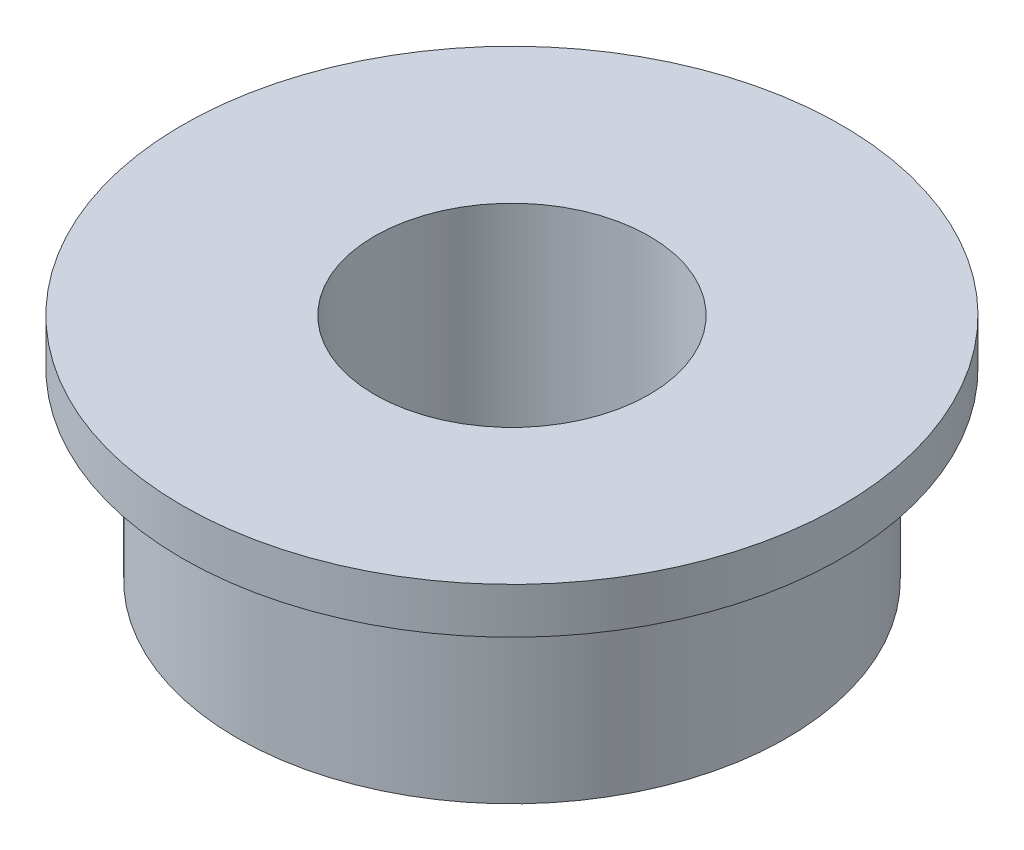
ISO-10303-21;
HEADER;
FILE_DESCRIPTION(('STEP AP214'),'2;1');
FILE_NAME('part.step','',(''),(''),'','','');
FILE_SCHEMA(('AUTOMOTIVE_DESIGN { 1 0 10303 214 1 1 1 1 }'));
ENDSEC;
DATA;
#1=APPLICATION_CONTEXT('core data for automotive mechanical design processes');
#2=APPLICATION_PROTOCOL_DEFINITION('international standard','automotive_design',2000,#1);
#3=PRODUCT_CONTEXT('',#1,'mechanical');
#4=PRODUCT('Part','Part','',(#3));
#5=PRODUCT_RELATED_PRODUCT_CATEGORY('part','',(#4));
#6=PRODUCT_DEFINITION_FORMATION('','',#4);
#7=PRODUCT_DEFINITION_CONTEXT('part definition',#1,'design');
#8=PRODUCT_DEFINITION('design','',#6,#7);
#9=PRODUCT_DEFINITION_SHAPE('','',#8);
#10=(LENGTH_UNIT() NAMED_UNIT(*) SI_UNIT(.MILLI.,.METRE.));
#11=(NAMED_UNIT(*) PLANE_ANGLE_UNIT() SI_UNIT($,.RADIAN.));
#12=(NAMED_UNIT(*) SI_UNIT($,.STERADIAN.) SOLID_ANGLE_UNIT());
#13=UNCERTAINTY_MEASURE_WITH_UNIT(LENGTH_MEASURE(1.E-05),#10,'distance_accuracy_value','');
#14=(GEOMETRIC_REPRESENTATION_CONTEXT(3) GLOBAL_UNCERTAINTY_ASSIGNED_CONTEXT((#13)) GLOBAL_UNIT_ASSIGNED_CONTEXT((#10,
#11,#12)) REPRESENTATION_CONTEXT('',''));
#15=CARTESIAN_POINT('',(0.,0.,0.));
#16=DIRECTION('',(0.,0.,1.));
#17=DIRECTION('',(1.,0.,0.));
#18=AXIS2_PLACEMENT_3D('',#15,#16,#17);
#19=CARTESIAN_POINT('',(0.,2.,0.));
#20=DIRECTION('',(0.,-1.,0.));
#21=DIRECTION('',(0.,0.,-1.));
#22=AXIS2_PLACEMENT_3D('',#19,#20,#21);
#23=CYLINDRICAL_SURFACE('',#22,1.5);
#24=CARTESIAN_POINT('',(0.,2.5,0.));
#25=DIRECTION('',(0.,1.,0.));
#26=DIRECTION('',(0.,0.,1.));
#27=AXIS2_PLACEMENT_3D('',#24,#25,#26);
#28=CIRCLE('',#27,1.5);
#29=CARTESIAN_POINT('',(0.,2.5,1.5));
#30=VERTEX_POINT('',#29);
#31=EDGE_CURVE('E49',#30,#30,#28,.T.);
#32=ORIENTED_EDGE('',*,*,#31,.T.);
#33=EDGE_LOOP('',(#32));
#34=FACE_BOUND('',#33,.T.);
#35=CARTESIAN_POINT('',(0.,0.1,0.));
#36=DIRECTION('',(0.,-1.,0.));
#37=DIRECTION('',(0.,0.,-1.));
#38=AXIS2_PLACEMENT_3D('',#35,#36,#37);
#39=CIRCLE('',#38,1.5);
#40=CARTESIAN_POINT('',(0.,0.1,-1.5));
#41=VERTEX_POINT('',#40);
#42=EDGE_CURVE('E35',#41,#41,#39,.T.);
#43=ORIENTED_EDGE('',*,*,#42,.T.);
#44=EDGE_LOOP('',(#43));
#45=FACE_BOUND('',#44,.T.);
#46=ADVANCED_FACE('F31',(#34,#45),#23,.F.);
#47=CARTESIAN_POINT('',(0.,0.,0.));
#48=DIRECTION('',(0.,1.,0.));
#49=DIRECTION('',(0.,0.,1.));
#50=AXIS2_PLACEMENT_3D('',#47,#48,#49);
#51=PLANE('',#50);
#52=CARTESIAN_POINT('',(0.,0.,0.));
#53=DIRECTION('',(0.,-1.,0.));
#54=DIRECTION('',(0.,0.,-1.));
#55=AXIS2_PLACEMENT_3D('',#52,#53,#54);
#56=CIRCLE('',#55,2.78649364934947);
#57=CARTESIAN_POINT('',(0.,0.,-2.78649364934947));
#58=VERTEX_POINT('',#57);
#59=EDGE_CURVE('E54',#58,#58,#56,.T.);
#60=ORIENTED_EDGE('',*,*,#59,.F.);
#61=EDGE_LOOP('',(#60));
#62=FACE_BOUND('',#61,.T.);
#63=CARTESIAN_POINT('',(0.,0.,0.));
#64=DIRECTION('',(0.,1.,0.));
#65=DIRECTION('',(0.,0.,1.));
#66=AXIS2_PLACEMENT_3D('',#63,#64,#65);
#67=CIRCLE('',#66,3.);
#68=CARTESIAN_POINT('',(0.,0.,3.));
#69=VERTEX_POINT('',#68);
#70=EDGE_CURVE('E39',#69,#69,#67,.T.);
#71=ORIENTED_EDGE('',*,*,#70,.F.);
#72=EDGE_LOOP('',(#71));
#73=FACE_BOUND('',#72,.T.);
#74=ADVANCED_FACE('F76',(#62,#73),#51,.F.);
#75=CARTESIAN_POINT('',(0.,2.,0.));
#76=DIRECTION('',(0.,-1.,0.));
#77=DIRECTION('',(0.,0.,-1.));
#78=AXIS2_PLACEMENT_3D('',#75,#76,#77);
#79=CYLINDRICAL_SURFACE('',#78,3.);
#80=CARTESIAN_POINT('',(0.,2.,0.));
#81=DIRECTION('',(0.,1.,0.));
#82=DIRECTION('',(0.,0.,1.));
#83=AXIS2_PLACEMENT_3D('',#80,#81,#82);
#84=CIRCLE('',#83,3.);
#85=CARTESIAN_POINT('',(0.,2.,3.));
#86=VERTEX_POINT('',#85);
#87=EDGE_CURVE('E10',#86,#86,#84,.T.);
#88=ORIENTED_EDGE('',*,*,#87,.F.);
#89=EDGE_LOOP('',(#88));
#90=FACE_BOUND('',#89,.T.);
#91=ORIENTED_EDGE('',*,*,#70,.T.);
#92=EDGE_LOOP('',(#91));
#93=FACE_BOUND('',#92,.T.);
#94=ADVANCED_FACE('F33',(#90,#93),#79,.T.);
#95=CARTESIAN_POINT('',(0.,2.5,0.));
#96=DIRECTION('',(0.,1.,0.));
#97=DIRECTION('',(0.,0.,1.));
#98=AXIS2_PLACEMENT_3D('',#95,#96,#97);
#99=PLANE('',#98);
#100=CARTESIAN_POINT('',(0.,2.5,0.));
#101=DIRECTION('',(0.,1.,0.));
#102=DIRECTION('',(0.,0.,1.));
#103=AXIS2_PLACEMENT_3D('',#100,#101,#102);
#104=CIRCLE('',#103,3.6);
#105=CARTESIAN_POINT('',(0.,2.5,3.6));
#106=VERTEX_POINT('',#105);
#107=EDGE_CURVE('E44',#106,#106,#104,.T.);
#108=ORIENTED_EDGE('',*,*,#107,.T.);
#109=EDGE_LOOP('',(#108));
#110=FACE_BOUND('',#109,.T.);
#111=ORIENTED_EDGE('',*,*,#31,.F.);
#112=EDGE_LOOP('',(#111));
#113=FACE_BOUND('',#112,.T.);
#114=ADVANCED_FACE('F90',(#110,#113),#99,.T.);
#115=CARTESIAN_POINT('',(0.,2.,0.));
#116=DIRECTION('',(0.,1.,0.));
#117=DIRECTION('',(0.,0.,1.));
#118=AXIS2_PLACEMENT_3D('',#115,#116,#117);
#119=PLANE('',#118);
#120=ORIENTED_EDGE('',*,*,#87,.T.);
#121=EDGE_LOOP('',(#120));
#122=FACE_BOUND('',#121,.T.);
#123=CARTESIAN_POINT('',(0.,2.,0.));
#124=DIRECTION('',(0.,1.,0.));
#125=DIRECTION('',(0.,0.,1.));
#126=AXIS2_PLACEMENT_3D('',#123,#124,#125);
#127=CIRCLE('',#126,3.6);
#128=CARTESIAN_POINT('',(0.,2.,3.6));
#129=VERTEX_POINT('',#128);
#130=EDGE_CURVE('E46',#129,#129,#127,.T.);
#131=ORIENTED_EDGE('',*,*,#130,.F.);
#132=EDGE_LOOP('',(#131));
#133=FACE_BOUND('',#132,.T.);
#134=ADVANCED_FACE('F86',(#122,#133),#119,.F.);
#135=CARTESIAN_POINT('',(0.,2.5,0.));
#136=DIRECTION('',(0.,-1.,0.));
#137=DIRECTION('',(0.,0.,-1.));
#138=AXIS2_PLACEMENT_3D('',#135,#136,#137);
#139=CYLINDRICAL_SURFACE('',#138,3.6);
#140=ORIENTED_EDGE('',*,*,#107,.F.);
#141=EDGE_LOOP('',(#140));
#142=FACE_BOUND('',#141,.T.);
#143=ORIENTED_EDGE('',*,*,#130,.T.);
#144=EDGE_LOOP('',(#143));
#145=FACE_BOUND('',#144,.T.);
#146=ADVANCED_FACE('F72',(#142,#145),#139,.T.);
#147=CARTESIAN_POINT('',(0.,0.1,0.));
#148=DIRECTION('',(0.,-1.,0.));
#149=DIRECTION('',(0.,0.,-1.));
#150=AXIS2_PLACEMENT_3D('',#147,#148,#149);
#151=CYLINDRICAL_SURFACE('',#150,2.78649364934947);
#152=CARTESIAN_POINT('',(0.,0.1,0.));
#153=DIRECTION('',(0.,-1.,0.));
#154=DIRECTION('',(0.,0.,-1.));
#155=AXIS2_PLACEMENT_3D('',#152,#153,#154);
#156=CIRCLE('',#155,2.78649364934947);
#157=CARTESIAN_POINT('',(0.,0.1,-2.78649364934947));
#158=VERTEX_POINT('',#157);
#159=EDGE_CURVE('E57',#158,#158,#156,.T.);
#160=ORIENTED_EDGE('',*,*,#159,.F.);
#161=EDGE_LOOP('',(#160));
#162=FACE_BOUND('',#161,.T.);
#163=ORIENTED_EDGE('',*,*,#59,.T.);
#164=EDGE_LOOP('',(#163));
#165=FACE_BOUND('',#164,.T.);
#166=ADVANCED_FACE('F67',(#162,#165),#151,.F.);
#167=CARTESIAN_POINT('',(0.,0.1,0.));
#168=DIRECTION('',(0.,-1.,0.));
#169=DIRECTION('',(0.,0.,-1.));
#170=AXIS2_PLACEMENT_3D('',#167,#168,#169);
#171=PLANE('',#170);
#172=ORIENTED_EDGE('',*,*,#42,.F.);
#173=EDGE_LOOP('',(#172));
#174=FACE_BOUND('',#173,.T.);
#175=ORIENTED_EDGE('',*,*,#159,.T.);
#176=EDGE_LOOP('',(#175));
#177=FACE_BOUND('',#176,.T.);
#178=ADVANCED_FACE('F65',(#174,#177),#171,.T.);
#179=CLOSED_SHELL('',(#46,#74,#94,#114,#134,#146,#166,#178));
#180=MANIFOLD_SOLID_BREP('B2',#179);
#181=ADVANCED_BREP_SHAPE_REPRESENTATION('',(#18,#180),#14);
#182=SHAPE_DEFINITION_REPRESENTATION(#9,#181);
ENDSEC;
END-ISO-10303-21;
